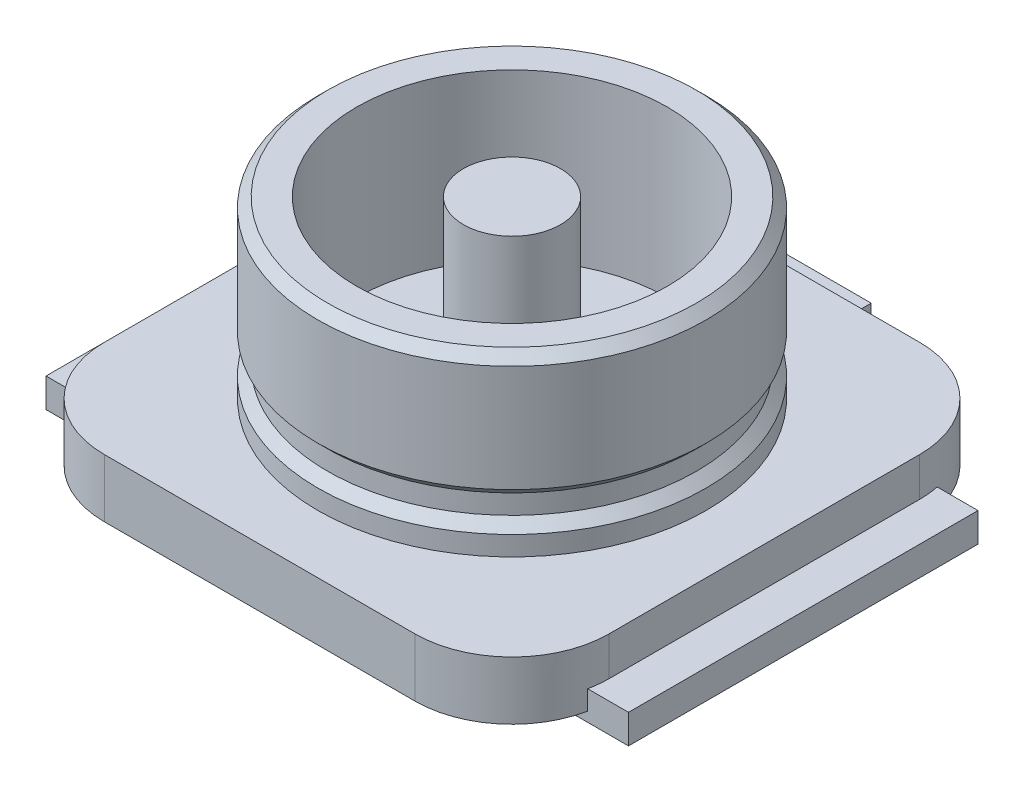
ISO-10303-21;
HEADER;
FILE_DESCRIPTION(('STEP AP214'),'2;1');
FILE_NAME('part.step','',(''),(''),'','','');
FILE_SCHEMA(('AUTOMOTIVE_DESIGN { 1 0 10303 214 1 1 1 1 }'));
ENDSEC;
DATA;
#1=APPLICATION_CONTEXT('core data for automotive mechanical design processes');
#2=APPLICATION_PROTOCOL_DEFINITION('international standard','automotive_design',2000,#1);
#3=PRODUCT_CONTEXT('',#1,'mechanical');
#4=PRODUCT('Part','Part','',(#3));
#5=PRODUCT_RELATED_PRODUCT_CATEGORY('part','',(#4));
#6=PRODUCT_DEFINITION_FORMATION('','',#4);
#7=PRODUCT_DEFINITION_CONTEXT('part definition',#1,'design');
#8=PRODUCT_DEFINITION('design','',#6,#7);
#9=PRODUCT_DEFINITION_SHAPE('','',#8);
#10=(LENGTH_UNIT() NAMED_UNIT(*) SI_UNIT(.MILLI.,.METRE.));
#11=(NAMED_UNIT(*) PLANE_ANGLE_UNIT() SI_UNIT($,.RADIAN.));
#12=(NAMED_UNIT(*) SI_UNIT($,.STERADIAN.) SOLID_ANGLE_UNIT());
#13=UNCERTAINTY_MEASURE_WITH_UNIT(LENGTH_MEASURE(1.E-05),#10,'distance_accuracy_value','');
#14=(GEOMETRIC_REPRESENTATION_CONTEXT(3) GLOBAL_UNCERTAINTY_ASSIGNED_CONTEXT((#13)) GLOBAL_UNIT_ASSIGNED_CONTEXT((#10,
#11,#12)) REPRESENTATION_CONTEXT('',''));
#15=CARTESIAN_POINT('',(0.,0.,0.));
#16=DIRECTION('',(0.,0.,1.));
#17=DIRECTION('',(1.,0.,0.));
#18=AXIS2_PLACEMENT_3D('',#15,#16,#17);
#19=CARTESIAN_POINT('',(-0.8,0.05,0.8));
#20=DIRECTION('',(0.,-1.,0.));
#21=DIRECTION('',(0.,0.,-1.));
#22=AXIS2_PLACEMENT_3D('',#19,#20,#21);
#23=PLANE('',#22);
#24=CARTESIAN_POINT('',(0.8,0.05,-0.8));
#25=DIRECTION('',(0.,1.,0.));
#26=DIRECTION('',(0.,0.,-1.));
#27=AXIS2_PLACEMENT_3D('',#24,#25,#26);
#28=CIRCLE('',#27,0.5);
#29=CARTESIAN_POINT('',(1.28989794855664,0.05,-0.9));
#30=VERTEX_POINT('',#29);
#31=CARTESIAN_POINT('',(0.8,0.05,-1.3));
#32=VERTEX_POINT('',#31);
#33=EDGE_CURVE('E404',#30,#32,#28,.T.);
#34=ORIENTED_EDGE('',*,*,#33,.F.);
#35=DIRECTION('',(-1.,0.,0.));
#36=VECTOR('',#35,1.);
#37=CARTESIAN_POINT('',(-0.799999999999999,0.05,-0.900000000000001));
#38=LINE('',#37,#36);
#39=CARTESIAN_POINT('',(1.1,0.05,-0.9));
#40=VERTEX_POINT('',#39);
#41=EDGE_CURVE('E272',#30,#40,#38,.T.);
#42=ORIENTED_EDGE('',*,*,#41,.T.);
#43=DIRECTION('',(0.,0.,1.));
#44=VECTOR('',#43,1.);
#45=CARTESIAN_POINT('',(1.1,0.05,0.8));
#46=LINE('',#45,#44);
#47=CARTESIAN_POINT('',(1.1,0.05,0.9));
#48=VERTEX_POINT('',#47);
#49=EDGE_CURVE('E11',#40,#48,#46,.T.);
#50=ORIENTED_EDGE('',*,*,#49,.T.);
#51=DIRECTION('',(1.,0.,0.));
#52=VECTOR('',#51,1.);
#53=CARTESIAN_POINT('',(-0.8,0.05,0.900000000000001));
#54=LINE('',#53,#52);
#55=CARTESIAN_POINT('',(1.28989794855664,0.05,0.9));
#56=VERTEX_POINT('',#55);
#57=EDGE_CURVE('E274',#48,#56,#54,.T.);
#58=ORIENTED_EDGE('',*,*,#57,.T.);
#59=CARTESIAN_POINT('',(0.8,0.05,0.8));
#60=DIRECTION('',(0.,1.,0.));
#61=DIRECTION('',(0.,0.,1.));
#62=AXIS2_PLACEMENT_3D('',#59,#60,#61);
#63=CIRCLE('',#62,0.5);
#64=CARTESIAN_POINT('',(0.8,0.05,1.3));
#65=VERTEX_POINT('',#64);
#66=EDGE_CURVE('E401',#65,#56,#63,.T.);
#67=ORIENTED_EDGE('',*,*,#66,.F.);
#68=DIRECTION('',(1.,0.,0.));
#69=VECTOR('',#68,1.);
#70=CARTESIAN_POINT('',(-0.8,0.05,1.3));
#71=LINE('',#70,#69);
#72=CARTESIAN_POINT('',(-0.8,0.05,1.3));
#73=VERTEX_POINT('',#72);
#74=EDGE_CURVE('E399',#73,#65,#71,.T.);
#75=ORIENTED_EDGE('',*,*,#74,.F.);
#76=CARTESIAN_POINT('',(-0.8,0.05,0.8));
#77=DIRECTION('',(0.,1.,0.));
#78=DIRECTION('',(0.,0.,-1.));
#79=AXIS2_PLACEMENT_3D('',#76,#77,#78);
#80=CIRCLE('',#79,0.5);
#81=CARTESIAN_POINT('',(-1.28989794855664,0.05,0.9));
#82=VERTEX_POINT('',#81);
#83=EDGE_CURVE('E397',#82,#73,#80,.T.);
#84=ORIENTED_EDGE('',*,*,#83,.F.);
#85=DIRECTION('',(1.,0.,0.));
#86=VECTOR('',#85,1.);
#87=CARTESIAN_POINT('',(-0.8,0.05,0.9));
#88=LINE('',#87,#86);
#89=CARTESIAN_POINT('',(-1.1,0.05,0.9));
#90=VERTEX_POINT('',#89);
#91=EDGE_CURVE('E463',#82,#90,#88,.T.);
#92=ORIENTED_EDGE('',*,*,#91,.T.);
#93=DIRECTION('',(0.,0.,-1.));
#94=VECTOR('',#93,1.);
#95=CARTESIAN_POINT('',(-1.1,0.05,0.8));
#96=LINE('',#95,#94);
#97=CARTESIAN_POINT('',(-1.1,0.05,-0.9));
#98=VERTEX_POINT('',#97);
#99=EDGE_CURVE('E460',#90,#98,#96,.T.);
#100=ORIENTED_EDGE('',*,*,#99,.T.);
#101=DIRECTION('',(-1.,0.,0.));
#102=VECTOR('',#101,1.);
#103=CARTESIAN_POINT('',(-0.800000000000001,0.05,-0.9));
#104=LINE('',#103,#102);
#105=CARTESIAN_POINT('',(-1.28989794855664,0.05,-0.9));
#106=VERTEX_POINT('',#105);
#107=EDGE_CURVE('E457',#98,#106,#104,.T.);
#108=ORIENTED_EDGE('',*,*,#107,.T.);
#109=CARTESIAN_POINT('',(-0.8,0.05,-0.8));
#110=DIRECTION('',(0.,1.,0.));
#111=DIRECTION('',(0.,0.,-1.));
#112=AXIS2_PLACEMENT_3D('',#109,#110,#111);
#113=CIRCLE('',#112,0.5);
#114=CARTESIAN_POINT('',(-0.8,0.05,-1.3));
#115=VERTEX_POINT('',#114);
#116=EDGE_CURVE('E410',#115,#106,#113,.T.);
#117=ORIENTED_EDGE('',*,*,#116,.F.);
#118=DIRECTION('',(-1.,0.,0.));
#119=VECTOR('',#118,1.);
#120=CARTESIAN_POINT('',(-0.8,0.05,-1.3));
#121=LINE('',#120,#119);
#122=CARTESIAN_POINT('',(-0.3,0.05,-1.3));
#123=VERTEX_POINT('',#122);
#124=EDGE_CURVE('E406',#123,#115,#121,.T.);
#125=ORIENTED_EDGE('',*,*,#124,.F.);
#126=DIRECTION('',(0.,0.,1.));
#127=VECTOR('',#126,1.);
#128=CARTESIAN_POINT('',(-0.3,0.05,0.8));
#129=LINE('',#128,#127);
#130=CARTESIAN_POINT('',(-0.3,0.05,-0.95));
#131=VERTEX_POINT('',#130);
#132=EDGE_CURVE('E325',#123,#131,#129,.T.);
#133=ORIENTED_EDGE('',*,*,#132,.T.);
#134=DIRECTION('',(1.,0.,0.));
#135=VECTOR('',#134,1.);
#136=CARTESIAN_POINT('',(-0.800000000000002,0.05,-0.95));
#137=LINE('',#136,#135);
#138=CARTESIAN_POINT('',(-0.2,0.05,-0.95));
#139=VERTEX_POINT('',#138);
#140=EDGE_CURVE('E488',#131,#139,#137,.T.);
#141=ORIENTED_EDGE('',*,*,#140,.T.);
#142=DIRECTION('',(0.,0.,1.));
#143=VECTOR('',#142,1.);
#144=CARTESIAN_POINT('',(-0.2,0.05,0.8));
#145=LINE('',#144,#143);
#146=CARTESIAN_POINT('',(-0.2,0.05,-0.346410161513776));
#147=VERTEX_POINT('',#146);
#148=EDGE_CURVE('E485',#139,#147,#145,.T.);
#149=ORIENTED_EDGE('',*,*,#148,.T.);
#150=CARTESIAN_POINT('',(0.,0.05,0.));
#151=DIRECTION('',(0.,-1.,0.));
#152=DIRECTION('',(0.,0.,-1.));
#153=AXIS2_PLACEMENT_3D('',#150,#151,#152);
#154=CIRCLE('',#153,0.4);
#155=CARTESIAN_POINT('',(0.2,0.05,-0.346410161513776));
#156=VERTEX_POINT('',#155);
#157=EDGE_CURVE('E482',#147,#156,#154,.F.);
#158=ORIENTED_EDGE('',*,*,#157,.T.);
#159=DIRECTION('',(0.,0.,-1.));
#160=VECTOR('',#159,1.);
#161=CARTESIAN_POINT('',(0.2,0.05,0.8));
#162=LINE('',#161,#160);
#163=CARTESIAN_POINT('',(0.2,0.05,-0.95));
#164=VERTEX_POINT('',#163);
#165=EDGE_CURVE('E479',#156,#164,#162,.T.);
#166=ORIENTED_EDGE('',*,*,#165,.T.);
#167=DIRECTION('',(1.,0.,0.));
#168=VECTOR('',#167,1.);
#169=CARTESIAN_POINT('',(-0.8,0.05,-0.95));
#170=LINE('',#169,#168);
#171=CARTESIAN_POINT('',(0.3,0.05,-0.95));
#172=VERTEX_POINT('',#171);
#173=EDGE_CURVE('E476',#164,#172,#170,.T.);
#174=ORIENTED_EDGE('',*,*,#173,.T.);
#175=DIRECTION('',(0.,0.,-1.));
#176=VECTOR('',#175,1.);
#177=CARTESIAN_POINT('',(0.3,0.05,0.8));
#178=LINE('',#177,#176);
#179=CARTESIAN_POINT('',(0.3,0.05,-1.3));
#180=VERTEX_POINT('',#179);
#181=EDGE_CURVE('E322',#172,#180,#178,.T.);
#182=ORIENTED_EDGE('',*,*,#181,.T.);
#183=EDGE_CURVE('E407',#32,#180,#121,.T.);
#184=ORIENTED_EDGE('',*,*,#183,.F.);
#185=EDGE_LOOP('',(#34,#42,#50,#58,#67,#75,#84,#92,#100,#108,#117,#125,#133,#141,#149,#158,#166,
#174,#182,#184));
#186=FACE_BOUND('',#185,.T.);
#187=ADVANCED_FACE('F32',(#186),#23,.T.);
#188=CARTESIAN_POINT('',(0.8,0.35,0.8));
#189=DIRECTION('',(0.,-1.,0.));
#190=DIRECTION('',(0.,0.,-1.));
#191=AXIS2_PLACEMENT_3D('',#188,#189,#190);
#192=CYLINDRICAL_SURFACE('',#191,0.5);
#193=DIRECTION('',(0.,-1.,0.));
#194=VECTOR('',#193,1.);
#195=CARTESIAN_POINT('',(1.28989794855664,0.35,0.9));
#196=LINE('',#195,#194);
#197=CARTESIAN_POINT('',(1.28989794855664,0.15,0.9));
#198=VERTEX_POINT('',#197);
#199=EDGE_CURVE('E40',#198,#56,#196,.T.);
#200=ORIENTED_EDGE('',*,*,#199,.F.);
#201=CARTESIAN_POINT('',(0.8,0.15,0.8));
#202=DIRECTION('',(0.,1.,0.));
#203=DIRECTION('',(0.,0.,1.));
#204=AXIS2_PLACEMENT_3D('',#201,#202,#203);
#205=CIRCLE('',#204,0.5);
#206=CARTESIAN_POINT('',(1.3,0.15,0.8));
#207=VERTEX_POINT('',#206);
#208=EDGE_CURVE('E269',#198,#207,#205,.T.);
#209=ORIENTED_EDGE('',*,*,#208,.T.);
#210=DIRECTION('',(0.,-1.,0.));
#211=VECTOR('',#210,1.);
#212=CARTESIAN_POINT('',(1.3,0.35,0.8));
#213=LINE('',#212,#211);
#214=CARTESIAN_POINT('',(1.3,0.35,0.8));
#215=VERTEX_POINT('',#214);
#216=EDGE_CURVE('E445',#215,#207,#213,.T.);
#217=ORIENTED_EDGE('',*,*,#216,.F.);
#218=CARTESIAN_POINT('',(0.8,0.35,0.8));
#219=DIRECTION('',(0.,1.,0.));
#220=DIRECTION('',(0.,0.,1.));
#221=AXIS2_PLACEMENT_3D('',#218,#219,#220);
#222=CIRCLE('',#221,0.5);
#223=CARTESIAN_POINT('',(0.8,0.35,1.3));
#224=VERTEX_POINT('',#223);
#225=EDGE_CURVE('E418',#224,#215,#222,.T.);
#226=ORIENTED_EDGE('',*,*,#225,.F.);
#227=DIRECTION('',(0.,-1.,0.));
#228=VECTOR('',#227,1.);
#229=CARTESIAN_POINT('',(0.8,0.35,1.3));
#230=LINE('',#229,#228);
#231=EDGE_CURVE('E448',#224,#65,#230,.T.);
#232=ORIENTED_EDGE('',*,*,#231,.T.);
#233=ORIENTED_EDGE('',*,*,#66,.T.);
#234=EDGE_LOOP('',(#200,#209,#217,#226,#232,#233));
#235=FACE_BOUND('',#234,.T.);
#236=ADVANCED_FACE('F505',(#235),#192,.T.);
#237=CARTESIAN_POINT('',(0.8,0.35,-0.8));
#238=DIRECTION('',(0.,-1.,0.));
#239=DIRECTION('',(0.,0.,-1.));
#240=AXIS2_PLACEMENT_3D('',#237,#238,#239);
#241=CYLINDRICAL_SURFACE('',#240,0.5);
#242=DIRECTION('',(0.,-1.,0.));
#243=VECTOR('',#242,1.);
#244=CARTESIAN_POINT('',(1.28989794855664,0.35,-0.9));
#245=LINE('',#244,#243);
#246=CARTESIAN_POINT('',(1.28989794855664,0.15,-0.9));
#247=VERTEX_POINT('',#246);
#248=EDGE_CURVE('E494',#30,#247,#245,.F.);
#249=ORIENTED_EDGE('',*,*,#248,.F.);
#250=ORIENTED_EDGE('',*,*,#33,.T.);
#251=DIRECTION('',(0.,-1.,0.));
#252=VECTOR('',#251,1.);
#253=CARTESIAN_POINT('',(0.8,0.35,-1.3));
#254=LINE('',#253,#252);
#255=CARTESIAN_POINT('',(0.8,0.35,-1.3));
#256=VERTEX_POINT('',#255);
#257=EDGE_CURVE('E439',#256,#32,#254,.T.);
#258=ORIENTED_EDGE('',*,*,#257,.F.);
#259=CARTESIAN_POINT('',(0.8,0.35,-0.8));
#260=DIRECTION('',(0.,1.,0.));
#261=DIRECTION('',(0.,0.,-1.));
#262=AXIS2_PLACEMENT_3D('',#259,#260,#261);
#263=CIRCLE('',#262,0.5);
#264=CARTESIAN_POINT('',(1.3,0.35,-0.8));
#265=VERTEX_POINT('',#264);
#266=EDGE_CURVE('E422',#265,#256,#263,.T.);
#267=ORIENTED_EDGE('',*,*,#266,.F.);
#268=DIRECTION('',(0.,-1.,0.));
#269=VECTOR('',#268,1.);
#270=CARTESIAN_POINT('',(1.3,0.35,-0.8));
#271=LINE('',#270,#269);
#272=CARTESIAN_POINT('',(1.3,0.15,-0.8));
#273=VERTEX_POINT('',#272);
#274=EDGE_CURVE('E442',#265,#273,#271,.T.);
#275=ORIENTED_EDGE('',*,*,#274,.T.);
#276=CARTESIAN_POINT('',(0.8,0.15,-0.8));
#277=DIRECTION('',(0.,1.,0.));
#278=DIRECTION('',(0.,0.,1.));
#279=AXIS2_PLACEMENT_3D('',#276,#277,#278);
#280=CIRCLE('',#279,0.5);
#281=EDGE_CURVE('E491',#273,#247,#280,.T.);
#282=ORIENTED_EDGE('',*,*,#281,.T.);
#283=EDGE_LOOP('',(#249,#250,#258,#267,#275,#282));
#284=FACE_BOUND('',#283,.T.);
#285=ADVANCED_FACE('F583',(#284),#241,.T.);
#286=CARTESIAN_POINT('',(-0.8,0.35,-1.3));
#287=DIRECTION('',(0.,0.,1.));
#288=DIRECTION('',(1.,0.,0.));
#289=AXIS2_PLACEMENT_3D('',#286,#287,#288);
#290=PLANE('',#289);
#291=DIRECTION('',(0.,1.,0.));
#292=VECTOR('',#291,1.);
#293=CARTESIAN_POINT('',(-0.3,0.35,-1.3));
#294=LINE('',#293,#292);
#295=CARTESIAN_POINT('',(-0.3,0.15,-1.3));
#296=VERTEX_POINT('',#295);
#297=EDGE_CURVE('E474',#123,#296,#294,.T.);
#298=ORIENTED_EDGE('',*,*,#297,.F.);
#299=ORIENTED_EDGE('',*,*,#124,.T.);
#300=DIRECTION('',(0.,-1.,0.));
#301=VECTOR('',#300,1.);
#302=CARTESIAN_POINT('',(-0.8,0.35,-1.3));
#303=LINE('',#302,#301);
#304=CARTESIAN_POINT('',(-0.8,0.35,-1.3));
#305=VERTEX_POINT('',#304);
#306=EDGE_CURVE('E436',#305,#115,#303,.T.);
#307=ORIENTED_EDGE('',*,*,#306,.F.);
#308=DIRECTION('',(-1.,0.,0.));
#309=VECTOR('',#308,1.);
#310=CARTESIAN_POINT('',(-0.8,0.35,-1.3));
#311=LINE('',#310,#309);
#312=EDGE_CURVE('E424',#256,#305,#311,.T.);
#313=ORIENTED_EDGE('',*,*,#312,.F.);
#314=ORIENTED_EDGE('',*,*,#257,.T.);
#315=ORIENTED_EDGE('',*,*,#183,.T.);
#316=DIRECTION('',(0.,-1.,0.));
#317=VECTOR('',#316,1.);
#318=CARTESIAN_POINT('',(0.3,0.35,-1.3));
#319=LINE('',#318,#317);
#320=CARTESIAN_POINT('',(0.3,0.15,-1.3));
#321=VERTEX_POINT('',#320);
#322=EDGE_CURVE('E472',#321,#180,#319,.T.);
#323=ORIENTED_EDGE('',*,*,#322,.F.);
#324=DIRECTION('',(-1.,0.,0.));
#325=VECTOR('',#324,1.);
#326=CARTESIAN_POINT('',(-0.8,0.15,-1.3));
#327=LINE('',#326,#325);
#328=EDGE_CURVE('E469',#321,#296,#327,.T.);
#329=ORIENTED_EDGE('',*,*,#328,.T.);
#330=EDGE_LOOP('',(#298,#299,#307,#313,#314,#315,#323,#329));
#331=FACE_BOUND('',#330,.T.);
#332=ADVANCED_FACE('F547',(#331),#290,.F.);
#333=CARTESIAN_POINT('',(-0.8,0.35,0.8));
#334=DIRECTION('',(0.,-1.,0.));
#335=DIRECTION('',(0.,0.,-1.));
#336=AXIS2_PLACEMENT_3D('',#333,#334,#335);
#337=CYLINDRICAL_SURFACE('',#336,0.5);
#338=DIRECTION('',(0.,-1.,0.));
#339=VECTOR('',#338,1.);
#340=CARTESIAN_POINT('',(-1.28989794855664,0.35,0.9));
#341=LINE('',#340,#339);
#342=CARTESIAN_POINT('',(-1.28989794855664,0.15,0.9));
#343=VERTEX_POINT('',#342);
#344=EDGE_CURVE('E359',#82,#343,#341,.F.);
#345=ORIENTED_EDGE('',*,*,#344,.F.);
#346=ORIENTED_EDGE('',*,*,#83,.T.);
#347=DIRECTION('',(0.,-1.,0.));
#348=VECTOR('',#347,1.);
#349=CARTESIAN_POINT('',(-0.8,0.35,1.3));
#350=LINE('',#349,#348);
#351=CARTESIAN_POINT('',(-0.8,0.35,1.3));
#352=VERTEX_POINT('',#351);
#353=EDGE_CURVE('E451',#352,#73,#350,.T.);
#354=ORIENTED_EDGE('',*,*,#353,.F.);
#355=CARTESIAN_POINT('',(-0.8,0.35,0.8));
#356=DIRECTION('',(0.,1.,0.));
#357=DIRECTION('',(0.,0.,-1.));
#358=AXIS2_PLACEMENT_3D('',#355,#356,#357);
#359=CIRCLE('',#358,0.5);
#360=CARTESIAN_POINT('',(-1.3,0.35,0.8));
#361=VERTEX_POINT('',#360);
#362=EDGE_CURVE('E413',#361,#352,#359,.T.);
#363=ORIENTED_EDGE('',*,*,#362,.F.);
#364=DIRECTION('',(0.,-1.,0.));
#365=VECTOR('',#364,1.);
#366=CARTESIAN_POINT('',(-1.3,0.35,0.8));
#367=LINE('',#366,#365);
#368=CARTESIAN_POINT('',(-1.3,0.15,0.8));
#369=VERTEX_POINT('',#368);
#370=EDGE_CURVE('E430',#361,#369,#367,.T.);
#371=ORIENTED_EDGE('',*,*,#370,.T.);
#372=CARTESIAN_POINT('',(-0.8,0.15,0.8));
#373=DIRECTION('',(0.,1.,0.));
#374=DIRECTION('',(0.,0.,1.));
#375=AXIS2_PLACEMENT_3D('',#372,#373,#374);
#376=CIRCLE('',#375,0.5);
#377=EDGE_CURVE('E364',#369,#343,#376,.T.);
#378=ORIENTED_EDGE('',*,*,#377,.T.);
#379=EDGE_LOOP('',(#345,#346,#354,#363,#371,#378));
#380=FACE_BOUND('',#379,.T.);
#381=ADVANCED_FACE('F34',(#380),#337,.T.);
#382=CARTESIAN_POINT('',(-0.8,0.35,-0.8));
#383=DIRECTION('',(0.,-1.,0.));
#384=DIRECTION('',(0.,0.,-1.));
#385=AXIS2_PLACEMENT_3D('',#382,#383,#384);
#386=CYLINDRICAL_SURFACE('',#385,0.5);
#387=DIRECTION('',(0.,-1.,0.));
#388=VECTOR('',#387,1.);
#389=CARTESIAN_POINT('',(-1.28989794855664,0.35,-0.9));
#390=LINE('',#389,#388);
#391=CARTESIAN_POINT('',(-1.28989794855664,0.15,-0.9));
#392=VERTEX_POINT('',#391);
#393=EDGE_CURVE('E357',#392,#106,#390,.T.);
#394=ORIENTED_EDGE('',*,*,#393,.F.);
#395=CARTESIAN_POINT('',(-0.8,0.15,-0.8));
#396=DIRECTION('',(0.,1.,0.));
#397=DIRECTION('',(0.,0.,1.));
#398=AXIS2_PLACEMENT_3D('',#395,#396,#397);
#399=CIRCLE('',#398,0.5);
#400=CARTESIAN_POINT('',(-1.3,0.15,-0.8));
#401=VERTEX_POINT('',#400);
#402=EDGE_CURVE('E361',#392,#401,#399,.T.);
#403=ORIENTED_EDGE('',*,*,#402,.T.);
#404=DIRECTION('',(0.,-1.,0.));
#405=VECTOR('',#404,1.);
#406=CARTESIAN_POINT('',(-1.3,0.35,-0.8));
#407=LINE('',#406,#405);
#408=CARTESIAN_POINT('',(-1.3,0.35,-0.8));
#409=VERTEX_POINT('',#408);
#410=EDGE_CURVE('E433',#409,#401,#407,.T.);
#411=ORIENTED_EDGE('',*,*,#410,.F.);
#412=CARTESIAN_POINT('',(-0.8,0.35,-0.8));
#413=DIRECTION('',(0.,1.,0.));
#414=DIRECTION('',(0.,0.,-1.));
#415=AXIS2_PLACEMENT_3D('',#412,#413,#414);
#416=CIRCLE('',#415,0.5);
#417=EDGE_CURVE('E426',#305,#409,#416,.T.);
#418=ORIENTED_EDGE('',*,*,#417,.F.);
#419=ORIENTED_EDGE('',*,*,#306,.T.);
#420=ORIENTED_EDGE('',*,*,#116,.T.);
#421=EDGE_LOOP('',(#394,#403,#411,#418,#419,#420));
#422=FACE_BOUND('',#421,.T.);
#423=ADVANCED_FACE('F540',(#422),#386,.T.);
#424=CARTESIAN_POINT('',(-0.8,0.35,0.8));
#425=DIRECTION('',(0.,-1.,0.));
#426=DIRECTION('',(0.,0.,-1.));
#427=AXIS2_PLACEMENT_3D('',#424,#425,#426);
#428=PLANE('',#427);
#429=ORIENTED_EDGE('',*,*,#362,.T.);
#430=DIRECTION('',(1.,0.,0.));
#431=VECTOR('',#430,1.);
#432=CARTESIAN_POINT('',(-0.8,0.35,1.3));
#433=LINE('',#432,#431);
#434=EDGE_CURVE('E416',#352,#224,#433,.T.);
#435=ORIENTED_EDGE('',*,*,#434,.T.);
#436=ORIENTED_EDGE('',*,*,#225,.T.);
#437=DIRECTION('',(0.,0.,-1.));
#438=VECTOR('',#437,1.);
#439=CARTESIAN_POINT('',(1.3,0.35,0.8));
#440=LINE('',#439,#438);
#441=EDGE_CURVE('E420',#215,#265,#440,.T.);
#442=ORIENTED_EDGE('',*,*,#441,.T.);
#443=ORIENTED_EDGE('',*,*,#266,.T.);
#444=ORIENTED_EDGE('',*,*,#312,.T.);
#445=ORIENTED_EDGE('',*,*,#417,.T.);
#446=DIRECTION('',(0.,0.,1.));
#447=VECTOR('',#446,1.);
#448=CARTESIAN_POINT('',(-1.3,0.35,0.8));
#449=LINE('',#448,#447);
#450=EDGE_CURVE('E428',#409,#361,#449,.T.);
#451=ORIENTED_EDGE('',*,*,#450,.T.);
#452=EDGE_LOOP('',(#429,#435,#436,#442,#443,#444,#445,#451));
#453=FACE_BOUND('',#452,.T.);
#454=CARTESIAN_POINT('',(0.,0.35,0.));
#455=DIRECTION('',(0.,-1.,0.));
#456=DIRECTION('',(0.,0.,-1.));
#457=AXIS2_PLACEMENT_3D('',#454,#455,#456);
#458=CIRCLE('',#457,1.);
#459=CARTESIAN_POINT('',(0.,0.35,-1.));
#460=VERTEX_POINT('',#459);
#461=EDGE_CURVE('E454',#460,#460,#458,.F.);
#462=ORIENTED_EDGE('',*,*,#461,.F.);
#463=EDGE_LOOP('',(#462));
#464=FACE_BOUND('',#463,.T.);
#465=ADVANCED_FACE('F611',(#453,#464),#428,.F.);
#466=CARTESIAN_POINT('',(-0.8,0.35,1.3));
#467=DIRECTION('',(0.,0.,-1.));
#468=DIRECTION('',(-1.,0.,0.));
#469=AXIS2_PLACEMENT_3D('',#466,#467,#468);
#470=PLANE('',#469);
#471=ORIENTED_EDGE('',*,*,#74,.T.);
#472=ORIENTED_EDGE('',*,*,#231,.F.);
#473=ORIENTED_EDGE('',*,*,#434,.F.);
#474=ORIENTED_EDGE('',*,*,#353,.T.);
#475=EDGE_LOOP('',(#471,#472,#473,#474));
#476=FACE_BOUND('',#475,.T.);
#477=ADVANCED_FACE('F510',(#476),#470,.F.);
#478=CARTESIAN_POINT('',(1.3,0.35,0.8));
#479=DIRECTION('',(-1.,0.,0.));
#480=DIRECTION('',(0.,0.,1.));
#481=AXIS2_PLACEMENT_3D('',#478,#479,#480);
#482=PLANE('',#481);
#483=ORIENTED_EDGE('',*,*,#216,.T.);
#484=DIRECTION('',(0.,0.,-1.));
#485=VECTOR('',#484,1.);
#486=CARTESIAN_POINT('',(1.3,0.15,0.8));
#487=LINE('',#486,#485);
#488=EDGE_CURVE('E238',#207,#273,#487,.T.);
#489=ORIENTED_EDGE('',*,*,#488,.T.);
#490=ORIENTED_EDGE('',*,*,#274,.F.);
#491=ORIENTED_EDGE('',*,*,#441,.F.);
#492=EDGE_LOOP('',(#483,#489,#490,#491));
#493=FACE_BOUND('',#492,.T.);
#494=ADVANCED_FACE('F587',(#493),#482,.F.);
#495=CARTESIAN_POINT('',(-1.3,0.35,0.8));
#496=DIRECTION('',(1.,0.,0.));
#497=DIRECTION('',(0.,0.,-1.));
#498=AXIS2_PLACEMENT_3D('',#495,#496,#497);
#499=PLANE('',#498);
#500=ORIENTED_EDGE('',*,*,#410,.T.);
#501=DIRECTION('',(0.,0.,1.));
#502=VECTOR('',#501,1.);
#503=CARTESIAN_POINT('',(-1.3,0.15,0.8));
#504=LINE('',#503,#502);
#505=EDGE_CURVE('E466',#401,#369,#504,.T.);
#506=ORIENTED_EDGE('',*,*,#505,.T.);
#507=ORIENTED_EDGE('',*,*,#370,.F.);
#508=ORIENTED_EDGE('',*,*,#450,.F.);
#509=EDGE_LOOP('',(#500,#506,#507,#508));
#510=FACE_BOUND('',#509,.T.);
#511=ADVANCED_FACE('F615',(#510),#499,.F.);
#512=CARTESIAN_POINT('',(0.,1.25,0.));
#513=DIRECTION('',(0.,1.,0.));
#514=DIRECTION('',(-1.,0.,0.));
#515=AXIS2_PLACEMENT_3D('',#512,#513,#514);
#516=CYLINDRICAL_SURFACE('',#515,1.);
#517=CARTESIAN_POINT('',(0.,0.45,0.));
#518=DIRECTION('',(0.,1.,0.));
#519=DIRECTION('',(-1.,0.,0.));
#520=AXIS2_PLACEMENT_3D('',#517,#518,#519);
#521=CIRCLE('',#520,1.);
#522=CARTESIAN_POINT('',(-1.,0.45,0.));
#523=VERTEX_POINT('',#522);
#524=EDGE_CURVE('E394',#523,#523,#521,.T.);
#525=ORIENTED_EDGE('',*,*,#524,.F.);
#526=EDGE_LOOP('',(#525));
#527=FACE_BOUND('',#526,.T.);
#528=ORIENTED_EDGE('',*,*,#461,.T.);
#529=EDGE_LOOP('',(#528));
#530=FACE_BOUND('',#529,.T.);
#531=ADVANCED_FACE('F609',(#527,#530),#516,.T.);
#532=CARTESIAN_POINT('',(0.,0.45,0.));
#533=DIRECTION('',(0.,-1.,0.));
#534=DIRECTION('',(1.,0.,0.));
#535=AXIS2_PLACEMENT_3D('',#532,#533,#534);
#536=CONICAL_SURFACE('',#535,1.,0.785398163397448);
#537=CARTESIAN_POINT('',(0.,0.5,0.));
#538=DIRECTION('',(0.,1.,0.));
#539=DIRECTION('',(-1.,0.,0.));
#540=AXIS2_PLACEMENT_3D('',#537,#538,#539);
#541=CIRCLE('',#540,0.950000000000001);
#542=CARTESIAN_POINT('',(-0.950000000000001,0.5,0.));
#543=VERTEX_POINT('',#542);
#544=EDGE_CURVE('E391',#543,#543,#541,.T.);
#545=ORIENTED_EDGE('',*,*,#544,.F.);
#546=EDGE_LOOP('',(#545));
#547=FACE_BOUND('',#546,.T.);
#548=ORIENTED_EDGE('',*,*,#524,.T.);
#549=EDGE_LOOP('',(#548));
#550=FACE_BOUND('',#549,.T.);
#551=ADVANCED_FACE('F647',(#547,#550),#536,.T.);
#552=CARTESIAN_POINT('',(0.,1.25,0.));
#553=DIRECTION('',(0.,1.,0.));
#554=DIRECTION('',(-1.,0.,0.));
#555=AXIS2_PLACEMENT_3D('',#552,#553,#554);
#556=CYLINDRICAL_SURFACE('',#555,0.950000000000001);
#557=CARTESIAN_POINT('',(0.,0.6,0.));
#558=DIRECTION('',(0.,1.,0.));
#559=DIRECTION('',(-1.,0.,0.));
#560=AXIS2_PLACEMENT_3D('',#557,#558,#559);
#561=CIRCLE('',#560,0.95);
#562=CARTESIAN_POINT('',(-0.950000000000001,0.600000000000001,0.));
#563=VERTEX_POINT('',#562);
#564=EDGE_CURVE('E388',#563,#563,#561,.T.);
#565=ORIENTED_EDGE('',*,*,#564,.F.);
#566=EDGE_LOOP('',(#565));
#567=FACE_BOUND('',#566,.T.);
#568=ORIENTED_EDGE('',*,*,#544,.T.);
#569=EDGE_LOOP('',(#568));
#570=FACE_BOUND('',#569,.T.);
#571=ADVANCED_FACE('F654',(#567,#570),#556,.T.);
#572=CARTESIAN_POINT('',(0.,0.6,0.));
#573=DIRECTION('',(0.,1.,0.));
#574=DIRECTION('',(-1.,0.,0.));
#575=AXIS2_PLACEMENT_3D('',#572,#573,#574);
#576=CONICAL_SURFACE('',#575,0.95,0.785398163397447);
#577=CARTESIAN_POINT('',(0.,0.65,0.));
#578=DIRECTION('',(0.,1.,0.));
#579=DIRECTION('',(-1.,0.,0.));
#580=AXIS2_PLACEMENT_3D('',#577,#578,#579);
#581=CIRCLE('',#580,1.);
#582=CARTESIAN_POINT('',(-1.,0.650000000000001,0.));
#583=VERTEX_POINT('',#582);
#584=EDGE_CURVE('E385',#583,#583,#581,.T.);
#585=ORIENTED_EDGE('',*,*,#584,.F.);
#586=EDGE_LOOP('',(#585));
#587=FACE_BOUND('',#586,.T.);
#588=ORIENTED_EDGE('',*,*,#564,.T.);
#589=EDGE_LOOP('',(#588));
#590=FACE_BOUND('',#589,.T.);
#591=ADVANCED_FACE('F661',(#587,#590),#576,.T.);
#592=CARTESIAN_POINT('',(0.,1.25,0.));
#593=DIRECTION('',(0.,1.,0.));
#594=DIRECTION('',(-1.,0.,0.));
#595=AXIS2_PLACEMENT_3D('',#592,#593,#594);
#596=CYLINDRICAL_SURFACE('',#595,1.);
#597=CARTESIAN_POINT('',(0.,1.2,0.));
#598=DIRECTION('',(0.,1.,0.));
#599=DIRECTION('',(-1.,0.,0.));
#600=AXIS2_PLACEMENT_3D('',#597,#598,#599);
#601=CIRCLE('',#600,1.);
#602=CARTESIAN_POINT('',(-1.,1.2,0.));
#603=VERTEX_POINT('',#602);
#604=EDGE_CURVE('E382',#603,#603,#601,.T.);
#605=ORIENTED_EDGE('',*,*,#604,.F.);
#606=EDGE_LOOP('',(#605));
#607=FACE_BOUND('',#606,.T.);
#608=ORIENTED_EDGE('',*,*,#584,.T.);
#609=EDGE_LOOP('',(#608));
#610=FACE_BOUND('',#609,.T.);
#611=ADVANCED_FACE('F669',(#607,#610),#596,.T.);
#612=CARTESIAN_POINT('',(0.,1.2,0.));
#613=DIRECTION('',(0.,-1.,0.));
#614=DIRECTION('',(1.,0.,0.));
#615=AXIS2_PLACEMENT_3D('',#612,#613,#614);
#616=CONICAL_SURFACE('',#615,1.,0.785398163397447);
#617=CARTESIAN_POINT('',(0.,1.25,0.));
#618=DIRECTION('',(0.,1.,0.));
#619=DIRECTION('',(-1.,0.,0.));
#620=AXIS2_PLACEMENT_3D('',#617,#618,#619);
#621=CIRCLE('',#620,0.95);
#622=CARTESIAN_POINT('',(-0.95,1.25,0.));
#623=VERTEX_POINT('',#622);
#624=EDGE_CURVE('E379',#623,#623,#621,.T.);
#625=ORIENTED_EDGE('',*,*,#624,.F.);
#626=EDGE_LOOP('',(#625));
#627=FACE_BOUND('',#626,.T.);
#628=ORIENTED_EDGE('',*,*,#604,.T.);
#629=EDGE_LOOP('',(#628));
#630=FACE_BOUND('',#629,.T.);
#631=ADVANCED_FACE('F677',(#627,#630),#616,.T.);
#632=CARTESIAN_POINT('',(0.95,1.25,0.));
#633=DIRECTION('',(0.,-1.,0.));
#634=DIRECTION('',(1.,0.,0.));
#635=AXIS2_PLACEMENT_3D('',#632,#633,#634);
#636=PLANE('',#635);
#637=CARTESIAN_POINT('',(0.,1.25,0.));
#638=DIRECTION('',(0.,1.,0.));
#639=DIRECTION('',(-1.,0.,0.));
#640=AXIS2_PLACEMENT_3D('',#637,#638,#639);
#641=CIRCLE('',#640,0.8);
#642=CARTESIAN_POINT('',(-0.8,1.25,0.));
#643=VERTEX_POINT('',#642);
#644=EDGE_CURVE('E376',#643,#643,#641,.T.);
#645=ORIENTED_EDGE('',*,*,#644,.F.);
#646=EDGE_LOOP('',(#645));
#647=FACE_BOUND('',#646,.T.);
#648=ORIENTED_EDGE('',*,*,#624,.T.);
#649=EDGE_LOOP('',(#648));
#650=FACE_BOUND('',#649,.T.);
#651=ADVANCED_FACE('F685',(#647,#650),#636,.F.);
#652=CARTESIAN_POINT('',(0.,1.25,0.));
#653=DIRECTION('',(0.,1.,0.));
#654=DIRECTION('',(-1.,0.,0.));
#655=AXIS2_PLACEMENT_3D('',#652,#653,#654);
#656=CYLINDRICAL_SURFACE('',#655,0.8);
#657=CARTESIAN_POINT('',(0.,0.4,0.));
#658=DIRECTION('',(0.,1.,0.));
#659=DIRECTION('',(-1.,0.,0.));
#660=AXIS2_PLACEMENT_3D('',#657,#658,#659);
#661=CIRCLE('',#660,0.8);
#662=CARTESIAN_POINT('',(-0.800000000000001,0.400000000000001,0.));
#663=VERTEX_POINT('',#662);
#664=EDGE_CURVE('E373',#663,#663,#661,.T.);
#665=ORIENTED_EDGE('',*,*,#664,.F.);
#666=EDGE_LOOP('',(#665));
#667=FACE_BOUND('',#666,.T.);
#668=ORIENTED_EDGE('',*,*,#644,.T.);
#669=EDGE_LOOP('',(#668));
#670=FACE_BOUND('',#669,.T.);
#671=ADVANCED_FACE('F693',(#667,#670),#656,.F.);
#672=CARTESIAN_POINT('',(0.8,0.4,0.));
#673=DIRECTION('',(0.,-1.,0.));
#674=DIRECTION('',(1.,0.,0.));
#675=AXIS2_PLACEMENT_3D('',#672,#673,#674);
#676=PLANE('',#675);
#677=CARTESIAN_POINT('',(0.,0.4,0.));
#678=DIRECTION('',(0.,1.,0.));
#679=DIRECTION('',(-1.,0.,0.));
#680=AXIS2_PLACEMENT_3D('',#677,#678,#679);
#681=CIRCLE('',#680,0.25);
#682=CARTESIAN_POINT('',(-0.250000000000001,0.4,0.));
#683=VERTEX_POINT('',#682);
#684=EDGE_CURVE('E370',#683,#683,#681,.T.);
#685=ORIENTED_EDGE('',*,*,#684,.F.);
#686=EDGE_LOOP('',(#685));
#687=FACE_BOUND('',#686,.T.);
#688=ORIENTED_EDGE('',*,*,#664,.T.);
#689=EDGE_LOOP('',(#688));
#690=FACE_BOUND('',#689,.T.);
#691=ADVANCED_FACE('F701',(#687,#690),#676,.F.);
#692=CARTESIAN_POINT('',(0.,1.25,0.));
#693=DIRECTION('',(0.,1.,0.));
#694=DIRECTION('',(-1.,0.,0.));
#695=AXIS2_PLACEMENT_3D('',#692,#693,#694);
#696=CYLINDRICAL_SURFACE('',#695,0.25);
#697=CARTESIAN_POINT('',(0.,1.25,0.));
#698=DIRECTION('',(0.,1.,0.));
#699=DIRECTION('',(-1.,0.,0.));
#700=AXIS2_PLACEMENT_3D('',#697,#698,#699);
#701=CIRCLE('',#700,0.25);
#702=CARTESIAN_POINT('',(-0.25,1.25,0.));
#703=VERTEX_POINT('',#702);
#704=EDGE_CURVE('E367',#703,#703,#701,.T.);
#705=ORIENTED_EDGE('',*,*,#704,.F.);
#706=EDGE_LOOP('',(#705));
#707=FACE_BOUND('',#706,.T.);
#708=ORIENTED_EDGE('',*,*,#684,.T.);
#709=EDGE_LOOP('',(#708));
#710=FACE_BOUND('',#709,.T.);
#711=ADVANCED_FACE('F709',(#707,#710),#696,.T.);
#712=CARTESIAN_POINT('',(0.25,1.25,0.));
#713=DIRECTION('',(0.,-1.,0.));
#714=DIRECTION('',(1.,0.,0.));
#715=AXIS2_PLACEMENT_3D('',#712,#713,#714);
#716=PLANE('',#715);
#717=ORIENTED_EDGE('',*,*,#704,.T.);
#718=EDGE_LOOP('',(#717));
#719=FACE_BOUND('',#718,.T.);
#720=ADVANCED_FACE('F717',(#719),#716,.F.);
#721=CARTESIAN_POINT('',(-1.5,0.15,0.9));
#722=DIRECTION('',(0.,1.,0.));
#723=DIRECTION('',(0.,0.,1.));
#724=AXIS2_PLACEMENT_3D('',#721,#722,#723);
#725=PLANE('',#724);
#726=ORIENTED_EDGE('',*,*,#377,.F.);
#727=ORIENTED_EDGE('',*,*,#505,.F.);
#728=ORIENTED_EDGE('',*,*,#402,.F.);
#729=DIRECTION('',(-1.,0.,0.));
#730=VECTOR('',#729,1.);
#731=CARTESIAN_POINT('',(-1.5,0.15,-0.9));
#732=LINE('',#731,#730);
#733=CARTESIAN_POINT('',(-1.5,0.15,-0.9));
#734=VERTEX_POINT('',#733);
#735=EDGE_CURVE('E345',#392,#734,#732,.T.);
#736=ORIENTED_EDGE('',*,*,#735,.T.);
#737=DIRECTION('',(0.,0.,1.));
#738=VECTOR('',#737,1.);
#739=CARTESIAN_POINT('',(-1.5,0.15,-0.9));
#740=LINE('',#739,#738);
#741=CARTESIAN_POINT('',(-1.5,0.15,0.9));
#742=VERTEX_POINT('',#741);
#743=EDGE_CURVE('E339',#734,#742,#740,.T.);
#744=ORIENTED_EDGE('',*,*,#743,.T.);
#745=DIRECTION('',(1.,0.,0.));
#746=VECTOR('',#745,1.);
#747=CARTESIAN_POINT('',(-1.5,0.15,0.9));
#748=LINE('',#747,#746);
#749=EDGE_CURVE('E342',#742,#343,#748,.T.);
#750=ORIENTED_EDGE('',*,*,#749,.T.);
#751=EDGE_LOOP('',(#726,#727,#728,#736,#744,#750));
#752=FACE_BOUND('',#751,.T.);
#753=ADVANCED_FACE('F520',(#752),#725,.T.);
#754=CARTESIAN_POINT('',(-1.5,0.15,0.9));
#755=DIRECTION('',(0.,0.,-1.));
#756=DIRECTION('',(-1.,0.,0.));
#757=AXIS2_PLACEMENT_3D('',#754,#755,#756);
#758=PLANE('',#757);
#759=ORIENTED_EDGE('',*,*,#91,.F.);
#760=ORIENTED_EDGE('',*,*,#344,.T.);
#761=ORIENTED_EDGE('',*,*,#749,.F.);
#762=DIRECTION('',(0.,-1.,0.));
#763=VECTOR('',#762,1.);
#764=CARTESIAN_POINT('',(-1.5,0.15,0.9));
#765=LINE('',#764,#763);
#766=CARTESIAN_POINT('',(-1.5,0.,0.9));
#767=VERTEX_POINT('',#766);
#768=EDGE_CURVE('E354',#742,#767,#765,.T.);
#769=ORIENTED_EDGE('',*,*,#768,.T.);
#770=DIRECTION('',(1.,0.,0.));
#771=VECTOR('',#770,1.);
#772=CARTESIAN_POINT('',(-1.5,0.,0.9));
#773=LINE('',#772,#771);
#774=CARTESIAN_POINT('',(-1.1,0.,0.9));
#775=VERTEX_POINT('',#774);
#776=EDGE_CURVE('E331',#767,#775,#773,.T.);
#777=ORIENTED_EDGE('',*,*,#776,.T.);
#778=DIRECTION('',(0.,-1.,0.));
#779=VECTOR('',#778,1.);
#780=CARTESIAN_POINT('',(-1.1,0.15,0.9));
#781=LINE('',#780,#779);
#782=EDGE_CURVE('E352',#90,#775,#781,.T.);
#783=ORIENTED_EDGE('',*,*,#782,.F.);
#784=EDGE_LOOP('',(#759,#760,#761,#769,#777,#783));
#785=FACE_BOUND('',#784,.T.);
#786=ADVANCED_FACE('F517',(#785),#758,.F.);
#787=CARTESIAN_POINT('',(-1.5,0.15,-0.9));
#788=DIRECTION('',(0.,0.,1.));
#789=DIRECTION('',(1.,0.,0.));
#790=AXIS2_PLACEMENT_3D('',#787,#788,#789);
#791=PLANE('',#790);
#792=ORIENTED_EDGE('',*,*,#735,.F.);
#793=ORIENTED_EDGE('',*,*,#393,.T.);
#794=ORIENTED_EDGE('',*,*,#107,.F.);
#795=DIRECTION('',(0.,-1.,0.));
#796=VECTOR('',#795,1.);
#797=CARTESIAN_POINT('',(-1.1,0.15,-0.9));
#798=LINE('',#797,#796);
#799=CARTESIAN_POINT('',(-1.1,0.,-0.9));
#800=VERTEX_POINT('',#799);
#801=EDGE_CURVE('E350',#98,#800,#798,.T.);
#802=ORIENTED_EDGE('',*,*,#801,.T.);
#803=DIRECTION('',(-1.,0.,0.));
#804=VECTOR('',#803,1.);
#805=CARTESIAN_POINT('',(-1.5,0.,-0.9));
#806=LINE('',#805,#804);
#807=CARTESIAN_POINT('',(-1.5,0.,-0.9));
#808=VERTEX_POINT('',#807);
#809=EDGE_CURVE('E337',#800,#808,#806,.T.);
#810=ORIENTED_EDGE('',*,*,#809,.T.);
#811=DIRECTION('',(0.,-1.,0.));
#812=VECTOR('',#811,1.);
#813=CARTESIAN_POINT('',(-1.5,0.15,-0.9));
#814=LINE('',#813,#812);
#815=EDGE_CURVE('E347',#734,#808,#814,.T.);
#816=ORIENTED_EDGE('',*,*,#815,.F.);
#817=EDGE_LOOP('',(#792,#793,#794,#802,#810,#816));
#818=FACE_BOUND('',#817,.T.);
#819=ADVANCED_FACE('F737',(#818),#791,.F.);
#820=CARTESIAN_POINT('',(-1.5,0.15,-0.9));
#821=DIRECTION('',(1.,0.,0.));
#822=DIRECTION('',(0.,0.,-1.));
#823=AXIS2_PLACEMENT_3D('',#820,#821,#822);
#824=PLANE('',#823);
#825=DIRECTION('',(0.,0.,1.));
#826=VECTOR('',#825,1.);
#827=CARTESIAN_POINT('',(-1.5,0.,-0.9));
#828=LINE('',#827,#826);
#829=EDGE_CURVE('E328',#808,#767,#828,.T.);
#830=ORIENTED_EDGE('',*,*,#829,.T.);
#831=ORIENTED_EDGE('',*,*,#768,.F.);
#832=ORIENTED_EDGE('',*,*,#743,.F.);
#833=ORIENTED_EDGE('',*,*,#815,.T.);
#834=EDGE_LOOP('',(#830,#831,#832,#833));
#835=FACE_BOUND('',#834,.T.);
#836=ADVANCED_FACE('F526',(#835),#824,.F.);
#837=CARTESIAN_POINT('',(-1.1,0.15,-0.9));
#838=DIRECTION('',(-1.,0.,0.));
#839=DIRECTION('',(0.,0.,1.));
#840=AXIS2_PLACEMENT_3D('',#837,#838,#839);
#841=PLANE('',#840);
#842=ORIENTED_EDGE('',*,*,#99,.F.);
#843=ORIENTED_EDGE('',*,*,#782,.T.);
#844=DIRECTION('',(0.,0.,-1.));
#845=VECTOR('',#844,1.);
#846=CARTESIAN_POINT('',(-1.1,0.,-0.9));
#847=LINE('',#846,#845);
#848=EDGE_CURVE('E334',#775,#800,#847,.T.);
#849=ORIENTED_EDGE('',*,*,#848,.T.);
#850=ORIENTED_EDGE('',*,*,#801,.F.);
#851=EDGE_LOOP('',(#842,#843,#849,#850));
#852=FACE_BOUND('',#851,.T.);
#853=ADVANCED_FACE('F534',(#852),#841,.F.);
#854=CARTESIAN_POINT('',(-1.5,0.,0.9));
#855=DIRECTION('',(0.,1.,0.));
#856=DIRECTION('',(0.,0.,1.));
#857=AXIS2_PLACEMENT_3D('',#854,#855,#856);
#858=PLANE('',#857);
#859=ORIENTED_EDGE('',*,*,#829,.F.);
#860=ORIENTED_EDGE('',*,*,#809,.F.);
#861=ORIENTED_EDGE('',*,*,#848,.F.);
#862=ORIENTED_EDGE('',*,*,#776,.F.);
#863=EDGE_LOOP('',(#859,#860,#861,#862));
#864=FACE_BOUND('',#863,.T.);
#865=ADVANCED_FACE('F531',(#864),#858,.F.);
#866=CARTESIAN_POINT('',(0.,0.15,0.));
#867=DIRECTION('',(0.,1.,0.));
#868=DIRECTION('',(0.,0.,1.));
#869=AXIS2_PLACEMENT_3D('',#866,#867,#868);
#870=PLANE('',#869);
#871=ORIENTED_EDGE('',*,*,#328,.F.);
#872=DIRECTION('',(0.,0.,-1.));
#873=VECTOR('',#872,1.);
#874=CARTESIAN_POINT('',(0.3,0.15,-1.55));
#875=LINE('',#874,#873);
#876=CARTESIAN_POINT('',(0.3,0.15,-1.55));
#877=VERTEX_POINT('',#876);
#878=EDGE_CURVE('E300',#321,#877,#875,.T.);
#879=ORIENTED_EDGE('',*,*,#878,.T.);
#880=DIRECTION('',(-1.,0.,0.));
#881=VECTOR('',#880,1.);
#882=CARTESIAN_POINT('',(-0.3,0.15,-1.55));
#883=LINE('',#882,#881);
#884=CARTESIAN_POINT('',(-0.3,0.15,-1.55));
#885=VERTEX_POINT('',#884);
#886=EDGE_CURVE('E302',#877,#885,#883,.T.);
#887=ORIENTED_EDGE('',*,*,#886,.T.);
#888=DIRECTION('',(0.,0.,1.));
#889=VECTOR('',#888,1.);
#890=CARTESIAN_POINT('',(-0.3,0.15,-1.55));
#891=LINE('',#890,#889);
#892=EDGE_CURVE('E55',#885,#296,#891,.T.);
#893=ORIENTED_EDGE('',*,*,#892,.T.);
#894=EDGE_LOOP('',(#871,#879,#887,#893));
#895=FACE_BOUND('',#894,.T.);
#896=ADVANCED_FACE('F762',(#895),#870,.T.);
#897=CARTESIAN_POINT('',(-0.3,0.15,-1.55));
#898=DIRECTION('',(1.,0.,0.));
#899=DIRECTION('',(0.,0.,-1.));
#900=AXIS2_PLACEMENT_3D('',#897,#898,#899);
#901=PLANE('',#900);
#902=ORIENTED_EDGE('',*,*,#132,.F.);
#903=ORIENTED_EDGE('',*,*,#297,.T.);
#904=ORIENTED_EDGE('',*,*,#892,.F.);
#905=DIRECTION('',(0.,-1.,0.));
#906=VECTOR('',#905,1.);
#907=CARTESIAN_POINT('',(-0.3,0.15,-1.55));
#908=LINE('',#907,#906);
#909=CARTESIAN_POINT('',(-0.3,0.,-1.55));
#910=VERTEX_POINT('',#909);
#911=EDGE_CURVE('E304',#885,#910,#908,.T.);
#912=ORIENTED_EDGE('',*,*,#911,.T.);
#913=DIRECTION('',(0.,0.,1.));
#914=VECTOR('',#913,1.);
#915=CARTESIAN_POINT('',(-0.3,0.,-1.55));
#916=LINE('',#915,#914);
#917=CARTESIAN_POINT('',(-0.3,0.,-0.95));
#918=VERTEX_POINT('',#917);
#919=EDGE_CURVE('E277',#910,#918,#916,.T.);
#920=ORIENTED_EDGE('',*,*,#919,.T.);
#921=DIRECTION('',(0.,-1.,0.));
#922=VECTOR('',#921,1.);
#923=CARTESIAN_POINT('',(-0.3,0.15,-0.95));
#924=LINE('',#923,#922);
#925=EDGE_CURVE('E320',#131,#918,#924,.T.);
#926=ORIENTED_EDGE('',*,*,#925,.F.);
#927=EDGE_LOOP('',(#902,#903,#904,#912,#920,#926));
#928=FACE_BOUND('',#927,.T.);
#929=ADVANCED_FACE('F550',(#928),#901,.F.);
#930=CARTESIAN_POINT('',(-0.3,0.15,-0.95));
#931=DIRECTION('',(0.,0.,-1.));
#932=DIRECTION('',(-1.,0.,0.));
#933=AXIS2_PLACEMENT_3D('',#930,#931,#932);
#934=PLANE('',#933);
#935=ORIENTED_EDGE('',*,*,#140,.F.);
#936=ORIENTED_EDGE('',*,*,#925,.T.);
#937=DIRECTION('',(1.,0.,0.));
#938=VECTOR('',#937,1.);
#939=CARTESIAN_POINT('',(-0.3,0.,-0.95));
#940=LINE('',#939,#938);
#941=CARTESIAN_POINT('',(-0.2,0.,-0.95));
#942=VERTEX_POINT('',#941);
#943=EDGE_CURVE('E280',#918,#942,#940,.T.);
#944=ORIENTED_EDGE('',*,*,#943,.T.);
#945=DIRECTION('',(0.,-1.,0.));
#946=VECTOR('',#945,1.);
#947=CARTESIAN_POINT('',(-0.2,0.15,-0.95));
#948=LINE('',#947,#946);
#949=EDGE_CURVE('E318',#139,#942,#948,.T.);
#950=ORIENTED_EDGE('',*,*,#949,.F.);
#951=EDGE_LOOP('',(#935,#936,#944,#950));
#952=FACE_BOUND('',#951,.T.);
#953=ADVANCED_FACE('F554',(#952),#934,.F.);
#954=CARTESIAN_POINT('',(-0.2,0.15,-0.346410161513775));
#955=DIRECTION('',(1.,0.,0.));
#956=DIRECTION('',(0.,0.,-1.));
#957=AXIS2_PLACEMENT_3D('',#954,#955,#956);
#958=PLANE('',#957);
#959=ORIENTED_EDGE('',*,*,#148,.F.);
#960=ORIENTED_EDGE('',*,*,#949,.T.);
#961=DIRECTION('',(0.,0.,1.));
#962=VECTOR('',#961,1.);
#963=CARTESIAN_POINT('',(-0.2,0.,-0.346410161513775));
#964=LINE('',#963,#962);
#965=CARTESIAN_POINT('',(-0.2,0.,-0.346410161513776));
#966=VERTEX_POINT('',#965);
#967=EDGE_CURVE('E283',#942,#966,#964,.T.);
#968=ORIENTED_EDGE('',*,*,#967,.T.);
#969=DIRECTION('',(0.,-1.,0.));
#970=VECTOR('',#969,1.);
#971=CARTESIAN_POINT('',(-0.2,0.15,-0.346410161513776));
#972=LINE('',#971,#970);
#973=EDGE_CURVE('E316',#147,#966,#972,.T.);
#974=ORIENTED_EDGE('',*,*,#973,.F.);
#975=EDGE_LOOP('',(#959,#960,#968,#974));
#976=FACE_BOUND('',#975,.T.);
#977=ADVANCED_FACE('F564',(#976),#958,.F.);
#978=CARTESIAN_POINT('',(0.,0.15,0.));
#979=DIRECTION('',(0.,-1.,0.));
#980=DIRECTION('',(0.,0.,-1.));
#981=AXIS2_PLACEMENT_3D('',#978,#979,#980);
#982=CYLINDRICAL_SURFACE('',#981,0.4);
#983=ORIENTED_EDGE('',*,*,#157,.F.);
#984=ORIENTED_EDGE('',*,*,#973,.T.);
#985=CARTESIAN_POINT('',(0.,0.,0.));
#986=DIRECTION('',(0.,1.,0.));
#987=DIRECTION('',(0.,0.,1.));
#988=AXIS2_PLACEMENT_3D('',#985,#986,#987);
#989=CIRCLE('',#988,0.4);
#990=CARTESIAN_POINT('',(0.2,0.,-0.346410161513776));
#991=VERTEX_POINT('',#990);
#992=EDGE_CURVE('E286',#966,#991,#989,.T.);
#993=ORIENTED_EDGE('',*,*,#992,.T.);
#994=DIRECTION('',(0.,-1.,0.));
#995=VECTOR('',#994,1.);
#996=CARTESIAN_POINT('',(0.2,0.15,-0.346410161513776));
#997=LINE('',#996,#995);
#998=EDGE_CURVE('E314',#156,#991,#997,.T.);
#999=ORIENTED_EDGE('',*,*,#998,.F.);
#1000=EDGE_LOOP('',(#983,#984,#993,#999));
#1001=FACE_BOUND('',#1000,.T.);
#1002=ADVANCED_FACE('F567',(#1001),#982,.T.);
#1003=CARTESIAN_POINT('',(0.2,0.15,-0.346410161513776));
#1004=DIRECTION('',(-1.,0.,0.));
#1005=DIRECTION('',(0.,0.,1.));
#1006=AXIS2_PLACEMENT_3D('',#1003,#1004,#1005);
#1007=PLANE('',#1006);
#1008=ORIENTED_EDGE('',*,*,#165,.F.);
#1009=ORIENTED_EDGE('',*,*,#998,.T.);
#1010=DIRECTION('',(0.,0.,-1.));
#1011=VECTOR('',#1010,1.);
#1012=CARTESIAN_POINT('',(0.2,0.,-0.346410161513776));
#1013=LINE('',#1012,#1011);
#1014=CARTESIAN_POINT('',(0.2,0.,-0.95));
#1015=VERTEX_POINT('',#1014);
#1016=EDGE_CURVE('E289',#991,#1015,#1013,.T.);
#1017=ORIENTED_EDGE('',*,*,#1016,.T.);
#1018=DIRECTION('',(0.,-1.,0.));
#1019=VECTOR('',#1018,1.);
#1020=CARTESIAN_POINT('',(0.2,0.15,-0.95));
#1021=LINE('',#1020,#1019);
#1022=EDGE_CURVE('E312',#164,#1015,#1021,.T.);
#1023=ORIENTED_EDGE('',*,*,#1022,.F.);
#1024=EDGE_LOOP('',(#1008,#1009,#1017,#1023));
#1025=FACE_BOUND('',#1024,.T.);
#1026=ADVANCED_FACE('F569',(#1025),#1007,.F.);
#1027=CARTESIAN_POINT('',(0.2,0.15,-0.95));
#1028=DIRECTION('',(0.,0.,-1.));
#1029=DIRECTION('',(-1.,0.,0.));
#1030=AXIS2_PLACEMENT_3D('',#1027,#1028,#1029);
#1031=PLANE('',#1030);
#1032=ORIENTED_EDGE('',*,*,#173,.F.);
#1033=ORIENTED_EDGE('',*,*,#1022,.T.);
#1034=DIRECTION('',(1.,0.,0.));
#1035=VECTOR('',#1034,1.);
#1036=CARTESIAN_POINT('',(0.2,0.,-0.95));
#1037=LINE('',#1036,#1035);
#1038=CARTESIAN_POINT('',(0.3,0.,-0.95));
#1039=VERTEX_POINT('',#1038);
#1040=EDGE_CURVE('E292',#1015,#1039,#1037,.T.);
#1041=ORIENTED_EDGE('',*,*,#1040,.T.);
#1042=DIRECTION('',(0.,-1.,0.));
#1043=VECTOR('',#1042,1.);
#1044=CARTESIAN_POINT('',(0.3,0.15,-0.95));
#1045=LINE('',#1044,#1043);
#1046=EDGE_CURVE('E310',#172,#1039,#1045,.T.);
#1047=ORIENTED_EDGE('',*,*,#1046,.F.);
#1048=EDGE_LOOP('',(#1032,#1033,#1041,#1047));
#1049=FACE_BOUND('',#1048,.T.);
#1050=ADVANCED_FACE('F573',(#1049),#1031,.F.);
#1051=CARTESIAN_POINT('',(0.3,0.15,-1.55));
#1052=DIRECTION('',(-1.,0.,0.));
#1053=DIRECTION('',(0.,0.,1.));
#1054=AXIS2_PLACEMENT_3D('',#1051,#1052,#1053);
#1055=PLANE('',#1054);
#1056=ORIENTED_EDGE('',*,*,#181,.F.);
#1057=ORIENTED_EDGE('',*,*,#1046,.T.);
#1058=DIRECTION('',(0.,0.,-1.));
#1059=VECTOR('',#1058,1.);
#1060=CARTESIAN_POINT('',(0.3,0.,-1.55));
#1061=LINE('',#1060,#1059);
#1062=CARTESIAN_POINT('',(0.3,0.,-1.55));
#1063=VERTEX_POINT('',#1062);
#1064=EDGE_CURVE('E295',#1039,#1063,#1061,.T.);
#1065=ORIENTED_EDGE('',*,*,#1064,.T.);
#1066=DIRECTION('',(0.,-1.,0.));
#1067=VECTOR('',#1066,1.);
#1068=CARTESIAN_POINT('',(0.3,0.15,-1.55));
#1069=LINE('',#1068,#1067);
#1070=EDGE_CURVE('E307',#877,#1063,#1069,.T.);
#1071=ORIENTED_EDGE('',*,*,#1070,.F.);
#1072=ORIENTED_EDGE('',*,*,#878,.F.);
#1073=ORIENTED_EDGE('',*,*,#322,.T.);
#1074=EDGE_LOOP('',(#1056,#1057,#1065,#1071,#1072,#1073));
#1075=FACE_BOUND('',#1074,.T.);
#1076=ADVANCED_FACE('F805',(#1075),#1055,.F.);
#1077=CARTESIAN_POINT('',(-0.3,0.15,-1.55));
#1078=DIRECTION('',(0.,0.,1.));
#1079=DIRECTION('',(1.,0.,0.));
#1080=AXIS2_PLACEMENT_3D('',#1077,#1078,#1079);
#1081=PLANE('',#1080);
#1082=DIRECTION('',(-1.,0.,0.));
#1083=VECTOR('',#1082,1.);
#1084=CARTESIAN_POINT('',(-0.3,0.,-1.55));
#1085=LINE('',#1084,#1083);
#1086=EDGE_CURVE('E297',#1063,#910,#1085,.T.);
#1087=ORIENTED_EDGE('',*,*,#1086,.T.);
#1088=ORIENTED_EDGE('',*,*,#911,.F.);
#1089=ORIENTED_EDGE('',*,*,#886,.F.);
#1090=ORIENTED_EDGE('',*,*,#1070,.T.);
#1091=EDGE_LOOP('',(#1087,#1088,#1089,#1090));
#1092=FACE_BOUND('',#1091,.T.);
#1093=ADVANCED_FACE('F812',(#1092),#1081,.F.);
#1094=CARTESIAN_POINT('',(0.,0.,0.));
#1095=DIRECTION('',(0.,1.,0.));
#1096=DIRECTION('',(0.,0.,1.));
#1097=AXIS2_PLACEMENT_3D('',#1094,#1095,#1096);
#1098=PLANE('',#1097);
#1099=ORIENTED_EDGE('',*,*,#919,.F.);
#1100=ORIENTED_EDGE('',*,*,#1086,.F.);
#1101=ORIENTED_EDGE('',*,*,#1064,.F.);
#1102=ORIENTED_EDGE('',*,*,#1040,.F.);
#1103=ORIENTED_EDGE('',*,*,#1016,.F.);
#1104=ORIENTED_EDGE('',*,*,#992,.F.);
#1105=ORIENTED_EDGE('',*,*,#967,.F.);
#1106=ORIENTED_EDGE('',*,*,#943,.F.);
#1107=EDGE_LOOP('',(#1099,#1100,#1101,#1102,#1103,#1104,#1105,#1106));
#1108=FACE_BOUND('',#1107,.T.);
#1109=ADVANCED_FACE('F558',(#1108),#1098,.F.);
#1110=CARTESIAN_POINT('',(1.1,0.15,-0.9));
#1111=DIRECTION('',(0.,1.,0.));
#1112=DIRECTION('',(0.,0.,1.));
#1113=AXIS2_PLACEMENT_3D('',#1110,#1111,#1112);
#1114=PLANE('',#1113);
#1115=ORIENTED_EDGE('',*,*,#208,.F.);
#1116=DIRECTION('',(1.,0.,0.));
#1117=VECTOR('',#1116,1.);
#1118=CARTESIAN_POINT('',(1.5,0.15,0.9));
#1119=LINE('',#1118,#1117);
#1120=CARTESIAN_POINT('',(1.5,0.15,0.9));
#1121=VERTEX_POINT('',#1120);
#1122=EDGE_CURVE('E258',#198,#1121,#1119,.T.);
#1123=ORIENTED_EDGE('',*,*,#1122,.T.);
#1124=DIRECTION('',(0.,0.,-1.));
#1125=VECTOR('',#1124,1.);
#1126=CARTESIAN_POINT('',(1.5,0.15,-0.9));
#1127=LINE('',#1126,#1125);
#1128=CARTESIAN_POINT('',(1.5,0.15,-0.9));
#1129=VERTEX_POINT('',#1128);
#1130=EDGE_CURVE('E260',#1121,#1129,#1127,.T.);
#1131=ORIENTED_EDGE('',*,*,#1130,.T.);
#1132=DIRECTION('',(-1.,0.,0.));
#1133=VECTOR('',#1132,1.);
#1134=CARTESIAN_POINT('',(1.5,0.15,-0.9));
#1135=LINE('',#1134,#1133);
#1136=EDGE_CURVE('E47',#1129,#247,#1135,.T.);
#1137=ORIENTED_EDGE('',*,*,#1136,.T.);
#1138=ORIENTED_EDGE('',*,*,#281,.F.);
#1139=ORIENTED_EDGE('',*,*,#488,.F.);
#1140=EDGE_LOOP('',(#1115,#1123,#1131,#1137,#1138,#1139));
#1141=FACE_BOUND('',#1140,.T.);
#1142=ADVANCED_FACE('F585',(#1141),#1114,.T.);
#1143=CARTESIAN_POINT('',(1.5,0.15,-0.9));
#1144=DIRECTION('',(0.,0.,1.));
#1145=DIRECTION('',(1.,0.,0.));
#1146=AXIS2_PLACEMENT_3D('',#1143,#1144,#1145);
#1147=PLANE('',#1146);
#1148=ORIENTED_EDGE('',*,*,#41,.F.);
#1149=ORIENTED_EDGE('',*,*,#248,.T.);
#1150=ORIENTED_EDGE('',*,*,#1136,.F.);
#1151=DIRECTION('',(0.,-1.,0.));
#1152=VECTOR('',#1151,1.);
#1153=CARTESIAN_POINT('',(1.5,0.15,-0.9));
#1154=LINE('',#1153,#1152);
#1155=CARTESIAN_POINT('',(1.5,0.,-0.9));
#1156=VERTEX_POINT('',#1155);
#1157=EDGE_CURVE('E251',#1129,#1156,#1154,.T.);
#1158=ORIENTED_EDGE('',*,*,#1157,.T.);
#1159=DIRECTION('',(-1.,0.,0.));
#1160=VECTOR('',#1159,1.);
#1161=CARTESIAN_POINT('',(1.5,0.,-0.9));
#1162=LINE('',#1161,#1160);
#1163=CARTESIAN_POINT('',(1.1,0.,-0.9));
#1164=VERTEX_POINT('',#1163);
#1165=EDGE_CURVE('E245',#1156,#1164,#1162,.T.);
#1166=ORIENTED_EDGE('',*,*,#1165,.T.);
#1167=DIRECTION('',(0.,-1.,0.));
#1168=VECTOR('',#1167,1.);
#1169=CARTESIAN_POINT('',(1.1,0.15,-0.9));
#1170=LINE('',#1169,#1168);
#1171=EDGE_CURVE('E229',#40,#1164,#1170,.T.);
#1172=ORIENTED_EDGE('',*,*,#1171,.F.);
#1173=EDGE_LOOP('',(#1148,#1149,#1150,#1158,#1166,#1172));
#1174=FACE_BOUND('',#1173,.T.);
#1175=ADVANCED_FACE('F249',(#1174),#1147,.F.);
#1176=CARTESIAN_POINT('',(1.1,0.15,-0.9));
#1177=DIRECTION('',(1.,0.,0.));
#1178=DIRECTION('',(0.,0.,-1.));
#1179=AXIS2_PLACEMENT_3D('',#1176,#1177,#1178);
#1180=PLANE('',#1179);
#1181=ORIENTED_EDGE('',*,*,#49,.F.);
#1182=ORIENTED_EDGE('',*,*,#1171,.T.);
#1183=DIRECTION('',(0.,0.,1.));
#1184=VECTOR('',#1183,1.);
#1185=CARTESIAN_POINT('',(1.1,0.,-0.9));
#1186=LINE('',#1185,#1184);
#1187=CARTESIAN_POINT('',(1.1,0.,0.9));
#1188=VERTEX_POINT('',#1187);
#1189=EDGE_CURVE('E233',#1164,#1188,#1186,.T.);
#1190=ORIENTED_EDGE('',*,*,#1189,.T.);
#1191=DIRECTION('',(0.,-1.,0.));
#1192=VECTOR('',#1191,1.);
#1193=CARTESIAN_POINT('',(1.1,0.15,0.9));
#1194=LINE('',#1193,#1192);
#1195=EDGE_CURVE('E239',#48,#1188,#1194,.T.);
#1196=ORIENTED_EDGE('',*,*,#1195,.F.);
#1197=EDGE_LOOP('',(#1181,#1182,#1190,#1196));
#1198=FACE_BOUND('',#1197,.T.);
#1199=ADVANCED_FACE('F231',(#1198),#1180,.F.);
#1200=CARTESIAN_POINT('',(1.5,0.15,0.9));
#1201=DIRECTION('',(0.,0.,-1.));
#1202=DIRECTION('',(-1.,0.,0.));
#1203=AXIS2_PLACEMENT_3D('',#1200,#1201,#1202);
#1204=PLANE('',#1203);
#1205=ORIENTED_EDGE('',*,*,#57,.F.);
#1206=ORIENTED_EDGE('',*,*,#1195,.T.);
#1207=DIRECTION('',(1.,0.,0.));
#1208=VECTOR('',#1207,1.);
#1209=CARTESIAN_POINT('',(1.5,0.,0.9));
#1210=LINE('',#1209,#1208);
#1211=CARTESIAN_POINT('',(1.5,0.,0.9));
#1212=VERTEX_POINT('',#1211);
#1213=EDGE_CURVE('E246',#1188,#1212,#1210,.T.);
#1214=ORIENTED_EDGE('',*,*,#1213,.T.);
#1215=DIRECTION('',(0.,-1.,0.));
#1216=VECTOR('',#1215,1.);
#1217=CARTESIAN_POINT('',(1.5,0.15,0.9));
#1218=LINE('',#1217,#1216);
#1219=EDGE_CURVE('E263',#1121,#1212,#1218,.T.);
#1220=ORIENTED_EDGE('',*,*,#1219,.F.);
#1221=ORIENTED_EDGE('',*,*,#1122,.F.);
#1222=ORIENTED_EDGE('',*,*,#199,.T.);
#1223=EDGE_LOOP('',(#1205,#1206,#1214,#1220,#1221,#1222));
#1224=FACE_BOUND('',#1223,.T.);
#1225=ADVANCED_FACE('F498',(#1224),#1204,.F.);
#1226=CARTESIAN_POINT('',(1.5,0.15,-0.9));
#1227=DIRECTION('',(-1.,0.,0.));
#1228=DIRECTION('',(0.,0.,1.));
#1229=AXIS2_PLACEMENT_3D('',#1226,#1227,#1228);
#1230=PLANE('',#1229);
#1231=DIRECTION('',(0.,0.,-1.));
#1232=VECTOR('',#1231,1.);
#1233=CARTESIAN_POINT('',(1.5,0.,-0.9));
#1234=LINE('',#1233,#1232);
#1235=EDGE_CURVE('E255',#1212,#1156,#1234,.T.);
#1236=ORIENTED_EDGE('',*,*,#1235,.T.);
#1237=ORIENTED_EDGE('',*,*,#1157,.F.);
#1238=ORIENTED_EDGE('',*,*,#1130,.F.);
#1239=ORIENTED_EDGE('',*,*,#1219,.T.);
#1240=EDGE_LOOP('',(#1236,#1237,#1238,#1239));
#1241=FACE_BOUND('',#1240,.T.);
#1242=ADVANCED_FACE('F591',(#1241),#1230,.F.);
#1243=CARTESIAN_POINT('',(1.1,0.,-0.9));
#1244=DIRECTION('',(0.,1.,0.));
#1245=DIRECTION('',(0.,0.,1.));
#1246=AXIS2_PLACEMENT_3D('',#1243,#1244,#1245);
#1247=PLANE('',#1246);
#1248=ORIENTED_EDGE('',*,*,#1165,.F.);
#1249=ORIENTED_EDGE('',*,*,#1235,.F.);
#1250=ORIENTED_EDGE('',*,*,#1213,.F.);
#1251=ORIENTED_EDGE('',*,*,#1189,.F.);
#1252=EDGE_LOOP('',(#1248,#1249,#1250,#1251));
#1253=FACE_BOUND('',#1252,.T.);
#1254=ADVANCED_FACE('F243',(#1253),#1247,.F.);
#1255=CLOSED_SHELL('',(#187,#236,#285,#332,#381,#423,#465,#477,#494,#511,#531,#551,#571,#591,
#611,#631,#651,#671,#691,#711,#720,#753,#786,#819,#836,#853,#865,#896,#929,#953,#977,#1002,
#1026,#1050,#1076,#1093,#1109,#1142,#1175,#1199,#1225,#1242,#1254));
#1256=MANIFOLD_SOLID_BREP('B2',#1255);
#1257=ADVANCED_BREP_SHAPE_REPRESENTATION('',(#18,#1256),#14);
#1258=SHAPE_DEFINITION_REPRESENTATION(#9,#1257);
ENDSEC;
END-ISO-10303-21;
